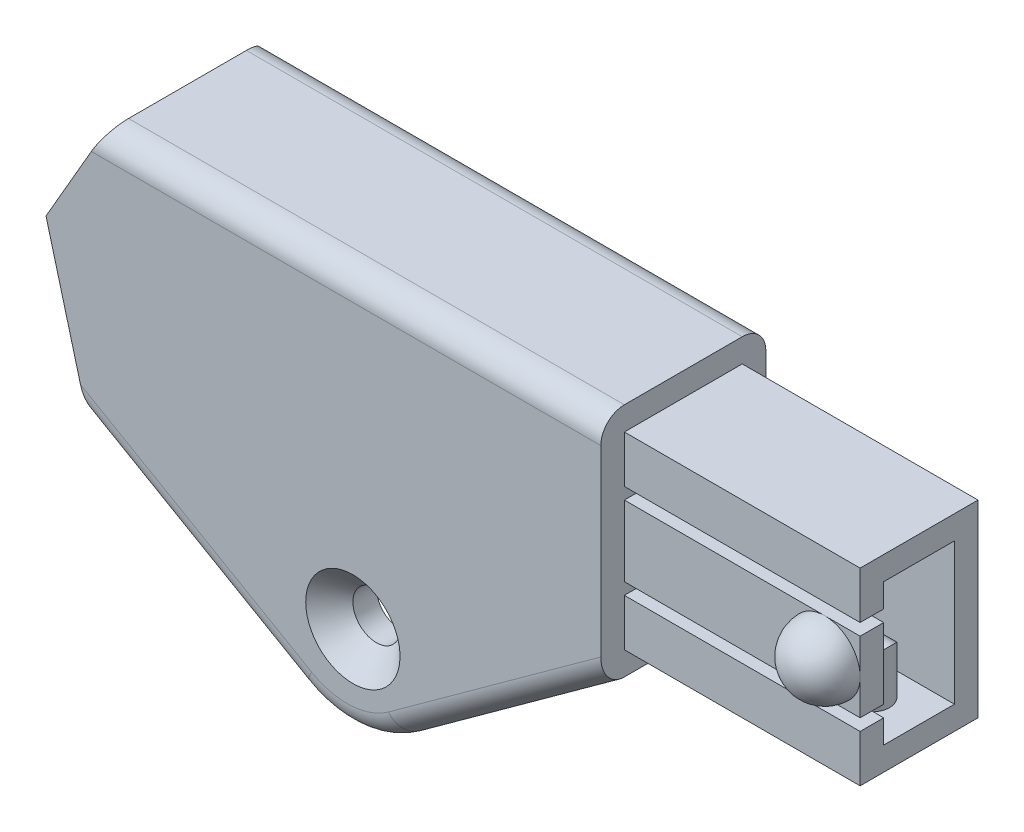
from build123d import *

# Parameters (mm, degrees)
EXTRUDE1_DEPTH     = 3.5
SKETCH5_W          = 5
SKETCH5_H          = 8
EXTRUDE3_DEPTH     = 10
CUT_EXTRUDE8_DEPTH = 1
SKETCH6_W          = 3
SKETCH6_H          = 6
CUT_EXTRUDE3_DEPTH = 32
CUT_EXTRUDE6_DEPTH = 1.5
SKETCH8_R          = 1
CUT_EXTRUDE7_DEPTH = 3.5
REVOLVE5_ANGLE     = 180
SKETCH11_R         = 0.75
FILLET2_R          = 4
FILLET3_R          = 1
CHAMFER1_SIZE      = 1


with BuildPart() as part:
    # Sketch1 → Extrude1 (new, symmetric)
    with BuildSketch(Plane.XY):
        Polygon((0, -5), (0, 5), (-21.033320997, 5), (-23.533320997, 0.669872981), (-21.703193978, -6.160254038), (-10.516660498, -12.618802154), align=None)
    extrude(amount=EXTRUDE1_DEPTH, both=True)

    # Sketch5 → Extrude3 (add)
    with BuildSketch(Plane(origin=(0, 0, 0), x_dir=(0, 0, -1), z_dir=(1, 0, 0))):
        Rectangle(SKETCH5_W, SKETCH5_H)
    extrude(amount=EXTRUDE3_DEPTH)

    # Sketch9 → Cut-Extrude8 (cut)
    with BuildSketch(Plane.XY.offset(2.5)):
        Polygon((0, 2), (0, 1.5), (10, 1.5), (10, -1.5), (0, -1.5), (0, -2), (10.5, -2), (10.5, 2), align=None)
    extrude(amount=-CUT_EXTRUDE8_DEPTH, mode=Mode.SUBTRACT)

    # Sketch6 → Cut-Extrude3 (cut)
    with BuildSketch(Plane(origin=(10, 0, 0), x_dir=(0, 0, -1), z_dir=(1, 0, 0))):
        Rectangle(SKETCH6_W, SKETCH6_H)
    extrude(amount=-CUT_EXTRUDE3_DEPTH, mode=Mode.SUBTRACT)

    # Sketch7 → Cut-Extrude6 (cut, symmetric)
    with BuildSketch(Plane.XY):
        Polygon((-23.533320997, 0.669872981), (-1, 0.669872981), (-1, -5.724450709), (-10.516660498, -12.618802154), (-21.703193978, -6.160254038), align=None)
    extrude(amount=CUT_EXTRUDE6_DEPTH, both=True, mode=Mode.SUBTRACT)

    # Sketch8 → Cut-Extrude7 (cut, symmetric)
    with BuildSketch(Plane.XY):
        with Locations((-10.516660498, -8)):
            Circle(SKETCH8_R)
    extrude(amount=CUT_EXTRUDE7_DEPTH, both=True, mode=Mode.SUBTRACT)

    # Sketch10 → Revolve5 (revolve)
    with BuildSketch(Plane.XY.offset(2.5)):
        with BuildLine():
            Line((7, 0), (10, 0))
            ThreePointArc((10, 0), (8.5, 1.5), (7, 0))
        make_face()
    revolve(axis=Axis((10, 0, 2.5), (1, 0, 0)), revolution_arc=REVOLVE5_ANGLE)

    # Sweep1: sweep along a path in Sketch12
    with BuildLine(Plane.XY) as sweep1_path:
        Line((8, -3), (8, -1.5))
        Line((8, -1.5), (4, -1.5))
    # Sketch11 → Sweep1 (sweep)
    with BuildSketch(Plane(origin=(0, -3, 0), x_dir=(-1, 0, 0), z_dir=(0, 1, 0))):
        with Locations((-8, 0)):
            Circle(SKETCH11_R)
    sweep(path=sweep1_path.line, transition=Transition.RIGHT)

    # Fillet2
    fillet2_edges = [part.edges().sort_by_distance(p)[0] for p in [
        (-10.516660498, -12.618802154, -2.5),
        (-10.516660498, -12.618802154, 2.5),
    ]]
    fillet(fillet2_edges, radius=FILLET2_R)

    # Fillet3
    fillet3_edges = [part.edges().sort_by_distance(p)[0] for p in [
        (-4.208098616, -8.048560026, -3.5),
        (-10.556294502, -11.852493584, -3.5),
        (-17.23304753, -8.741094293, -3.5),
        (-10.516660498, 5, -3.5),
        (-4.208098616, -8.048560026, 3.5),
        (-10.516660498, 5, 3.5),
        (-10.556294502, -11.852493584, 3.5),
        (-17.23304753, -8.741094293, 3.5),
    ]]
    fillet(fillet3_edges, radius=FILLET3_R)

    # Chamfer1
    chamfer1_edges = [part.edges().sort_by_distance(p)[0] for p in [
        (-11.516660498, -8, 3.5),
    ]]
    chamfer(chamfer1_edges, length=CHAMFER1_SIZE)


solid = part.part
